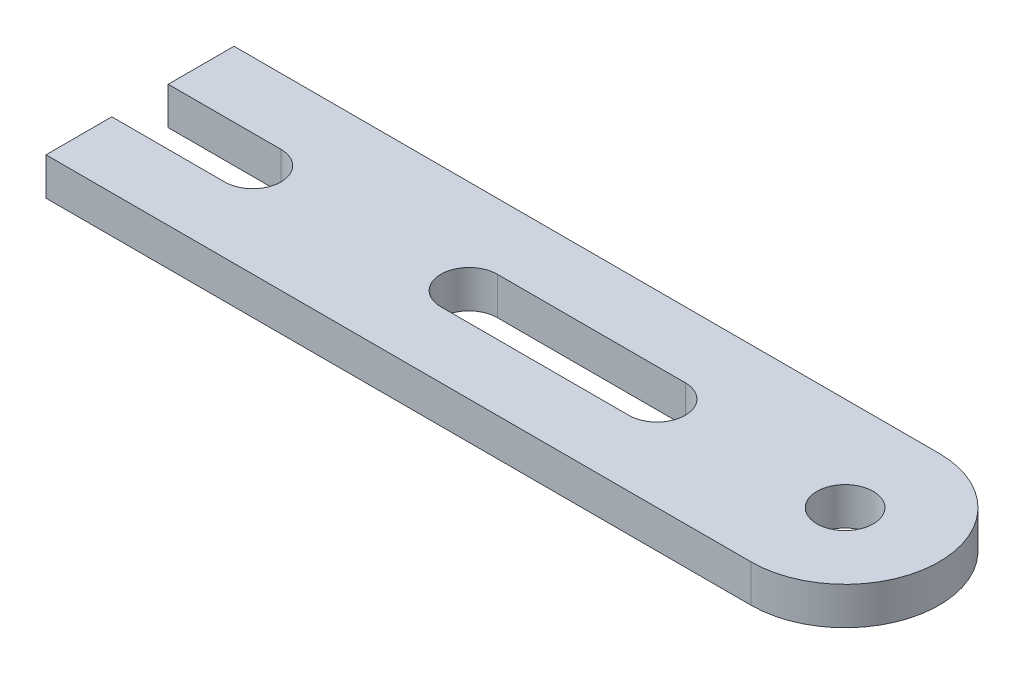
ISO-10303-21;
HEADER;
FILE_DESCRIPTION(('STEP AP214'),'2;1');
FILE_NAME('part.step','',(''),(''),'','','');
FILE_SCHEMA(('AUTOMOTIVE_DESIGN { 1 0 10303 214 1 1 1 1 }'));
ENDSEC;
DATA;
#1=APPLICATION_CONTEXT('core data for automotive mechanical design processes');
#2=APPLICATION_PROTOCOL_DEFINITION('international standard','automotive_design',2000,#1);
#3=PRODUCT_CONTEXT('',#1,'mechanical');
#4=PRODUCT('Part','Part','',(#3));
#5=PRODUCT_RELATED_PRODUCT_CATEGORY('part','',(#4));
#6=PRODUCT_DEFINITION_FORMATION('','',#4);
#7=PRODUCT_DEFINITION_CONTEXT('part definition',#1,'design');
#8=PRODUCT_DEFINITION('design','',#6,#7);
#9=PRODUCT_DEFINITION_SHAPE('','',#8);
#10=(LENGTH_UNIT() NAMED_UNIT(*) SI_UNIT(.MILLI.,.METRE.));
#11=(NAMED_UNIT(*) PLANE_ANGLE_UNIT() SI_UNIT($,.RADIAN.));
#12=(NAMED_UNIT(*) SI_UNIT($,.STERADIAN.) SOLID_ANGLE_UNIT());
#13=UNCERTAINTY_MEASURE_WITH_UNIT(LENGTH_MEASURE(1.E-05),#10,'distance_accuracy_value','');
#14=(GEOMETRIC_REPRESENTATION_CONTEXT(3) GLOBAL_UNCERTAINTY_ASSIGNED_CONTEXT((#13)) GLOBAL_UNIT_ASSIGNED_CONTEXT((#10,
#11,#12)) REPRESENTATION_CONTEXT('',''));
#15=CARTESIAN_POINT('',(0.,0.,0.));
#16=DIRECTION('',(0.,0.,1.));
#17=DIRECTION('',(1.,0.,0.));
#18=AXIS2_PLACEMENT_3D('',#15,#16,#17);
#19=CARTESIAN_POINT('',(0.,4.,0.));
#20=DIRECTION('',(0.,0.,-1.));
#21=DIRECTION('',(-1.,0.,0.));
#22=AXIS2_PLACEMENT_3D('',#19,#20,#21);
#23=PLANE('',#22);
#24=DIRECTION('',(0.,1.,0.));
#25=VECTOR('',#24,1.);
#26=CARTESIAN_POINT('',(75.,0.,0.));
#27=LINE('',#26,#25);
#28=CARTESIAN_POINT('',(75.,0.,0.));
#29=VERTEX_POINT('',#28);
#30=CARTESIAN_POINT('',(75.,4.,0.));
#31=VERTEX_POINT('',#30);
#32=EDGE_CURVE('E48',#29,#31,#27,.T.);
#33=ORIENTED_EDGE('',*,*,#32,.T.);
#34=DIRECTION('',(1.,0.,0.));
#35=VECTOR('',#34,1.);
#36=CARTESIAN_POINT('',(0.,4.,0.));
#37=LINE('',#36,#35);
#38=CARTESIAN_POINT('',(0.,4.,0.));
#39=VERTEX_POINT('',#38);
#40=EDGE_CURVE('E154',#39,#31,#37,.T.);
#41=ORIENTED_EDGE('',*,*,#40,.F.);
#42=DIRECTION('',(0.,-1.,0.));
#43=VECTOR('',#42,1.);
#44=CARTESIAN_POINT('',(0.,4.,0.));
#45=LINE('',#44,#43);
#46=CARTESIAN_POINT('',(0.,0.,0.));
#47=VERTEX_POINT('',#46);
#48=EDGE_CURVE('E11',#39,#47,#45,.T.);
#49=ORIENTED_EDGE('',*,*,#48,.T.);
#50=DIRECTION('',(1.,0.,0.));
#51=VECTOR('',#50,1.);
#52=CARTESIAN_POINT('',(0.,0.,0.));
#53=LINE('',#52,#51);
#54=EDGE_CURVE('E146',#47,#29,#53,.T.);
#55=ORIENTED_EDGE('',*,*,#54,.T.);
#56=EDGE_LOOP('',(#33,#41,#49,#55));
#57=FACE_BOUND('',#56,.T.);
#58=ADVANCED_FACE('F33',(#57),#23,.F.);
#59=CARTESIAN_POINT('',(0.,4.,0.));
#60=DIRECTION('',(1.,0.,0.));
#61=DIRECTION('',(0.,0.,-1.));
#62=AXIS2_PLACEMENT_3D('',#59,#60,#61);
#63=PLANE('',#62);
#64=DIRECTION('',(0.,0.,1.));
#65=VECTOR('',#64,1.);
#66=CARTESIAN_POINT('',(0.,4.,0.));
#67=LINE('',#66,#65);
#68=CARTESIAN_POINT('',(0.,4.,-7.));
#69=VERTEX_POINT('',#68);
#70=EDGE_CURVE('E145',#69,#39,#67,.T.);
#71=ORIENTED_EDGE('',*,*,#70,.F.);
#72=DIRECTION('',(0.,1.,0.));
#73=VECTOR('',#72,1.);
#74=CARTESIAN_POINT('',(0.,0.,-7.));
#75=LINE('',#74,#73);
#76=CARTESIAN_POINT('',(0.,0.,-7.));
#77=VERTEX_POINT('',#76);
#78=EDGE_CURVE('E181',#77,#69,#75,.T.);
#79=ORIENTED_EDGE('',*,*,#78,.F.);
#80=DIRECTION('',(0.,0.,1.));
#81=VECTOR('',#80,1.);
#82=CARTESIAN_POINT('',(0.,0.,0.));
#83=LINE('',#82,#81);
#84=EDGE_CURVE('E160',#77,#47,#83,.T.);
#85=ORIENTED_EDGE('',*,*,#84,.T.);
#86=ORIENTED_EDGE('',*,*,#48,.F.);
#87=EDGE_LOOP('',(#71,#79,#85,#86));
#88=FACE_BOUND('',#87,.T.);
#89=ADVANCED_FACE('F247',(#88),#63,.F.);
#90=CARTESIAN_POINT('',(0.,0.,-20.));
#91=VERTEX_POINT('',#90);
#92=CARTESIAN_POINT('',(0.,0.,-13.));
#93=VERTEX_POINT('',#92);
#94=EDGE_CURVE('E144',#91,#93,#83,.T.);
#95=ORIENTED_EDGE('',*,*,#94,.T.);
#96=DIRECTION('',(0.,1.,0.));
#97=VECTOR('',#96,1.);
#98=CARTESIAN_POINT('',(0.,0.,-13.));
#99=LINE('',#98,#97);
#100=CARTESIAN_POINT('',(0.,4.,-13.));
#101=VERTEX_POINT('',#100);
#102=EDGE_CURVE('E56',#93,#101,#99,.T.);
#103=ORIENTED_EDGE('',*,*,#102,.T.);
#104=CARTESIAN_POINT('',(0.,4.,-20.));
#105=VERTEX_POINT('',#104);
#106=EDGE_CURVE('E148',#105,#101,#67,.T.);
#107=ORIENTED_EDGE('',*,*,#106,.F.);
#108=DIRECTION('',(0.,-1.,0.));
#109=VECTOR('',#108,1.);
#110=CARTESIAN_POINT('',(0.,4.,-20.));
#111=LINE('',#110,#109);
#112=EDGE_CURVE('E41',#105,#91,#111,.T.);
#113=ORIENTED_EDGE('',*,*,#112,.T.);
#114=EDGE_LOOP('',(#95,#103,#107,#113));
#115=FACE_BOUND('',#114,.T.);
#116=ADVANCED_FACE('F35',(#115),#63,.F.);
#117=CARTESIAN_POINT('',(0.,4.,-20.));
#118=DIRECTION('',(0.,0.,1.));
#119=DIRECTION('',(1.,0.,0.));
#120=AXIS2_PLACEMENT_3D('',#117,#118,#119);
#121=PLANE('',#120);
#122=DIRECTION('',(-1.,0.,0.));
#123=VECTOR('',#122,1.);
#124=CARTESIAN_POINT('',(0.,4.,-20.));
#125=LINE('',#124,#123);
#126=CARTESIAN_POINT('',(75.,4.,-20.));
#127=VERTEX_POINT('',#126);
#128=EDGE_CURVE('E137',#127,#105,#125,.T.);
#129=ORIENTED_EDGE('',*,*,#128,.F.);
#130=DIRECTION('',(0.,1.,0.));
#131=VECTOR('',#130,1.);
#132=CARTESIAN_POINT('',(75.,0.,-20.));
#133=LINE('',#132,#131);
#134=CARTESIAN_POINT('',(75.,0.,-20.));
#135=VERTEX_POINT('',#134);
#136=EDGE_CURVE('E123',#135,#127,#133,.T.);
#137=ORIENTED_EDGE('',*,*,#136,.F.);
#138=DIRECTION('',(-1.,0.,0.));
#139=VECTOR('',#138,1.);
#140=CARTESIAN_POINT('',(0.,0.,-20.));
#141=LINE('',#140,#139);
#142=EDGE_CURVE('E135',#135,#91,#141,.T.);
#143=ORIENTED_EDGE('',*,*,#142,.T.);
#144=ORIENTED_EDGE('',*,*,#112,.F.);
#145=EDGE_LOOP('',(#129,#137,#143,#144));
#146=FACE_BOUND('',#145,.T.);
#147=ADVANCED_FACE('F133',(#146),#121,.F.);
#148=CARTESIAN_POINT('',(0.,4.,-20.));
#149=DIRECTION('',(0.,-1.,0.));
#150=DIRECTION('',(0.,0.,-1.));
#151=AXIS2_PLACEMENT_3D('',#148,#149,#150);
#152=PLANE('',#151);
#153=DIRECTION('',(1.,0.,0.));
#154=VECTOR('',#153,1.);
#155=CARTESIAN_POINT('',(35.,4.,-7.));
#156=LINE('',#155,#154);
#157=CARTESIAN_POINT('',(35.,4.,-7.));
#158=VERTEX_POINT('',#157);
#159=CARTESIAN_POINT('',(55.,4.,-7.));
#160=VERTEX_POINT('',#159);
#161=EDGE_CURVE('E205',#158,#160,#156,.T.);
#162=ORIENTED_EDGE('',*,*,#161,.F.);
#163=CARTESIAN_POINT('',(35.,4.,-10.));
#164=DIRECTION('',(0.,1.,0.));
#165=DIRECTION('',(0.,0.,1.));
#166=AXIS2_PLACEMENT_3D('',#163,#164,#165);
#167=CIRCLE('',#166,3.);
#168=CARTESIAN_POINT('',(35.,4.,-13.));
#169=VERTEX_POINT('',#168);
#170=EDGE_CURVE('E203',#169,#158,#167,.T.);
#171=ORIENTED_EDGE('',*,*,#170,.F.);
#172=DIRECTION('',(-1.,0.,0.));
#173=VECTOR('',#172,1.);
#174=CARTESIAN_POINT('',(35.,4.,-13.));
#175=LINE('',#174,#173);
#176=CARTESIAN_POINT('',(55.,4.,-13.));
#177=VERTEX_POINT('',#176);
#178=EDGE_CURVE('E194',#177,#169,#175,.T.);
#179=ORIENTED_EDGE('',*,*,#178,.F.);
#180=CARTESIAN_POINT('',(55.,4.,-10.));
#181=DIRECTION('',(0.,1.,0.));
#182=DIRECTION('',(0.,0.,1.));
#183=AXIS2_PLACEMENT_3D('',#180,#181,#182);
#184=CIRCLE('',#183,3.);
#185=EDGE_CURVE('E208',#160,#177,#184,.T.);
#186=ORIENTED_EDGE('',*,*,#185,.F.);
#187=EDGE_LOOP('',(#162,#171,#179,#186));
#188=FACE_BOUND('',#187,.T.);
#189=CARTESIAN_POINT('',(75.,4.,-10.));
#190=DIRECTION('',(0.,1.,0.));
#191=DIRECTION('',(0.,0.,1.));
#192=AXIS2_PLACEMENT_3D('',#189,#190,#191);
#193=CIRCLE('',#192,3.00000000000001);
#194=CARTESIAN_POINT('',(75.,4.,-6.99999999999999));
#195=VERTEX_POINT('',#194);
#196=EDGE_CURVE('E167',#195,#195,#193,.T.);
#197=ORIENTED_EDGE('',*,*,#196,.F.);
#198=EDGE_LOOP('',(#197));
#199=FACE_BOUND('',#198,.T.);
#200=ORIENTED_EDGE('',*,*,#40,.T.);
#201=CARTESIAN_POINT('',(75.,4.,-10.));
#202=DIRECTION('',(0.,-1.,0.));
#203=DIRECTION('',(0.,0.,1.));
#204=AXIS2_PLACEMENT_3D('',#201,#202,#203);
#205=CIRCLE('',#204,10.);
#206=EDGE_CURVE('E129',#127,#31,#205,.T.);
#207=ORIENTED_EDGE('',*,*,#206,.F.);
#208=ORIENTED_EDGE('',*,*,#128,.T.);
#209=ORIENTED_EDGE('',*,*,#106,.T.);
#210=DIRECTION('',(-1.,0.,0.));
#211=VECTOR('',#210,1.);
#212=CARTESIAN_POINT('',(12.,4.,-13.));
#213=LINE('',#212,#211);
#214=CARTESIAN_POINT('',(12.,4.,-13.));
#215=VERTEX_POINT('',#214);
#216=EDGE_CURVE('E180',#215,#101,#213,.T.);
#217=ORIENTED_EDGE('',*,*,#216,.F.);
#218=CARTESIAN_POINT('',(12.,4.,-10.));
#219=DIRECTION('',(0.,1.,0.));
#220=DIRECTION('',(0.,0.,1.));
#221=AXIS2_PLACEMENT_3D('',#218,#219,#220);
#222=CIRCLE('',#221,3.);
#223=CARTESIAN_POINT('',(12.,4.,-7.));
#224=VERTEX_POINT('',#223);
#225=EDGE_CURVE('E138',#224,#215,#222,.T.);
#226=ORIENTED_EDGE('',*,*,#225,.F.);
#227=DIRECTION('',(1.,0.,0.));
#228=VECTOR('',#227,1.);
#229=CARTESIAN_POINT('',(12.,4.,-7.));
#230=LINE('',#229,#228);
#231=EDGE_CURVE('E340',#69,#224,#230,.T.);
#232=ORIENTED_EDGE('',*,*,#231,.F.);
#233=ORIENTED_EDGE('',*,*,#70,.T.);
#234=EDGE_LOOP('',(#200,#207,#208,#209,#217,#226,#232,#233));
#235=FACE_BOUND('',#234,.T.);
#236=ADVANCED_FACE('F178',(#188,#199,#235),#152,.F.);
#237=CARTESIAN_POINT('',(0.,0.,-20.));
#238=DIRECTION('',(0.,-1.,0.));
#239=DIRECTION('',(0.,0.,-1.));
#240=AXIS2_PLACEMENT_3D('',#237,#238,#239);
#241=PLANE('',#240);
#242=CARTESIAN_POINT('',(75.,0.,-10.));
#243=DIRECTION('',(0.,-1.,0.));
#244=DIRECTION('',(0.,0.,1.));
#245=AXIS2_PLACEMENT_3D('',#242,#243,#244);
#246=CIRCLE('',#245,10.);
#247=EDGE_CURVE('E120',#135,#29,#246,.T.);
#248=ORIENTED_EDGE('',*,*,#247,.T.);
#249=ORIENTED_EDGE('',*,*,#54,.F.);
#250=ORIENTED_EDGE('',*,*,#84,.F.);
#251=DIRECTION('',(1.,0.,0.));
#252=VECTOR('',#251,1.);
#253=CARTESIAN_POINT('',(12.,0.,-7.));
#254=LINE('',#253,#252);
#255=CARTESIAN_POINT('',(12.,0.,-7.));
#256=VERTEX_POINT('',#255);
#257=EDGE_CURVE('E186',#77,#256,#254,.T.);
#258=ORIENTED_EDGE('',*,*,#257,.T.);
#259=CARTESIAN_POINT('',(12.,0.,-10.));
#260=DIRECTION('',(0.,1.,0.));
#261=DIRECTION('',(0.,0.,1.));
#262=AXIS2_PLACEMENT_3D('',#259,#260,#261);
#263=CIRCLE('',#262,3.);
#264=CARTESIAN_POINT('',(12.,0.,-13.));
#265=VERTEX_POINT('',#264);
#266=EDGE_CURVE('E343',#256,#265,#263,.T.);
#267=ORIENTED_EDGE('',*,*,#266,.T.);
#268=DIRECTION('',(-1.,0.,0.));
#269=VECTOR('',#268,1.);
#270=CARTESIAN_POINT('',(12.,0.,-13.));
#271=LINE('',#270,#269);
#272=EDGE_CURVE('E357',#265,#93,#271,.T.);
#273=ORIENTED_EDGE('',*,*,#272,.T.);
#274=ORIENTED_EDGE('',*,*,#94,.F.);
#275=ORIENTED_EDGE('',*,*,#142,.F.);
#276=EDGE_LOOP('',(#248,#249,#250,#258,#267,#273,#274,#275));
#277=FACE_BOUND('',#276,.T.);
#278=CARTESIAN_POINT('',(35.,0.,-10.));
#279=DIRECTION('',(0.,1.,0.));
#280=DIRECTION('',(0.,0.,1.));
#281=AXIS2_PLACEMENT_3D('',#278,#279,#280);
#282=CIRCLE('',#281,3.);
#283=CARTESIAN_POINT('',(35.,0.,-13.));
#284=VERTEX_POINT('',#283);
#285=CARTESIAN_POINT('',(35.,0.,-7.));
#286=VERTEX_POINT('',#285);
#287=EDGE_CURVE('E190',#284,#286,#282,.T.);
#288=ORIENTED_EDGE('',*,*,#287,.T.);
#289=DIRECTION('',(1.,0.,0.));
#290=VECTOR('',#289,1.);
#291=CARTESIAN_POINT('',(35.,0.,-7.));
#292=LINE('',#291,#290);
#293=CARTESIAN_POINT('',(55.,0.,-7.));
#294=VERTEX_POINT('',#293);
#295=EDGE_CURVE('E193',#286,#294,#292,.T.);
#296=ORIENTED_EDGE('',*,*,#295,.T.);
#297=CARTESIAN_POINT('',(55.,0.,-10.));
#298=DIRECTION('',(0.,1.,0.));
#299=DIRECTION('',(0.,0.,1.));
#300=AXIS2_PLACEMENT_3D('',#297,#298,#299);
#301=CIRCLE('',#300,3.);
#302=CARTESIAN_POINT('',(55.,0.,-13.));
#303=VERTEX_POINT('',#302);
#304=EDGE_CURVE('E197',#294,#303,#301,.T.);
#305=ORIENTED_EDGE('',*,*,#304,.T.);
#306=DIRECTION('',(-1.,0.,0.));
#307=VECTOR('',#306,1.);
#308=CARTESIAN_POINT('',(35.,0.,-13.));
#309=LINE('',#308,#307);
#310=EDGE_CURVE('E200',#303,#284,#309,.T.);
#311=ORIENTED_EDGE('',*,*,#310,.T.);
#312=EDGE_LOOP('',(#288,#296,#305,#311));
#313=FACE_BOUND('',#312,.T.);
#314=CARTESIAN_POINT('',(75.,0.,-10.));
#315=DIRECTION('',(0.,1.,0.));
#316=DIRECTION('',(0.,0.,1.));
#317=AXIS2_PLACEMENT_3D('',#314,#315,#316);
#318=CIRCLE('',#317,3.00000000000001);
#319=CARTESIAN_POINT('',(75.,0.,-6.99999999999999));
#320=VERTEX_POINT('',#319);
#321=EDGE_CURVE('E161',#320,#320,#318,.T.);
#322=ORIENTED_EDGE('',*,*,#321,.T.);
#323=EDGE_LOOP('',(#322));
#324=FACE_BOUND('',#323,.T.);
#325=ADVANCED_FACE('F141',(#277,#313,#324),#241,.T.);
#326=CARTESIAN_POINT('',(75.,0.,-10.));
#327=DIRECTION('',(0.,1.,0.));
#328=DIRECTION('',(0.,0.,1.));
#329=AXIS2_PLACEMENT_3D('',#326,#327,#328);
#330=CYLINDRICAL_SURFACE('',#329,3.00000000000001);
#331=ORIENTED_EDGE('',*,*,#321,.F.);
#332=EDGE_LOOP('',(#331));
#333=FACE_BOUND('',#332,.T.);
#334=ORIENTED_EDGE('',*,*,#196,.T.);
#335=EDGE_LOOP('',(#334));
#336=FACE_BOUND('',#335,.T.);
#337=ADVANCED_FACE('F236',(#333,#336),#330,.F.);
#338=CARTESIAN_POINT('',(35.,0.,-10.));
#339=DIRECTION('',(0.,1.,0.));
#340=DIRECTION('',(0.,0.,1.));
#341=AXIS2_PLACEMENT_3D('',#338,#339,#340);
#342=CYLINDRICAL_SURFACE('',#341,3.);
#343=ORIENTED_EDGE('',*,*,#170,.T.);
#344=DIRECTION('',(0.,1.,0.));
#345=VECTOR('',#344,1.);
#346=CARTESIAN_POINT('',(35.,0.,-7.));
#347=LINE('',#346,#345);
#348=EDGE_CURVE('E175',#286,#158,#347,.T.);
#349=ORIENTED_EDGE('',*,*,#348,.F.);
#350=ORIENTED_EDGE('',*,*,#287,.F.);
#351=DIRECTION('',(0.,1.,0.));
#352=VECTOR('',#351,1.);
#353=CARTESIAN_POINT('',(35.,0.,-13.));
#354=LINE('',#353,#352);
#355=EDGE_CURVE('E172',#284,#169,#354,.T.);
#356=ORIENTED_EDGE('',*,*,#355,.T.);
#357=EDGE_LOOP('',(#343,#349,#350,#356));
#358=FACE_BOUND('',#357,.T.);
#359=ADVANCED_FACE('F234',(#358),#342,.F.);
#360=CARTESIAN_POINT('',(35.,0.,-13.));
#361=DIRECTION('',(0.,0.,-1.));
#362=DIRECTION('',(-1.,0.,0.));
#363=AXIS2_PLACEMENT_3D('',#360,#361,#362);
#364=PLANE('',#363);
#365=ORIENTED_EDGE('',*,*,#178,.T.);
#366=ORIENTED_EDGE('',*,*,#355,.F.);
#367=ORIENTED_EDGE('',*,*,#310,.F.);
#368=DIRECTION('',(0.,1.,0.));
#369=VECTOR('',#368,1.);
#370=CARTESIAN_POINT('',(55.,0.,-13.));
#371=LINE('',#370,#369);
#372=EDGE_CURVE('E214',#303,#177,#371,.T.);
#373=ORIENTED_EDGE('',*,*,#372,.T.);
#374=EDGE_LOOP('',(#365,#366,#367,#373));
#375=FACE_BOUND('',#374,.T.);
#376=ADVANCED_FACE('F233',(#375),#364,.F.);
#377=CARTESIAN_POINT('',(55.,0.,-10.));
#378=DIRECTION('',(0.,1.,0.));
#379=DIRECTION('',(0.,0.,1.));
#380=AXIS2_PLACEMENT_3D('',#377,#378,#379);
#381=CYLINDRICAL_SURFACE('',#380,3.);
#382=ORIENTED_EDGE('',*,*,#185,.T.);
#383=ORIENTED_EDGE('',*,*,#372,.F.);
#384=ORIENTED_EDGE('',*,*,#304,.F.);
#385=DIRECTION('',(0.,1.,0.));
#386=VECTOR('',#385,1.);
#387=CARTESIAN_POINT('',(55.,0.,-7.));
#388=LINE('',#387,#386);
#389=EDGE_CURVE('E215',#294,#160,#388,.T.);
#390=ORIENTED_EDGE('',*,*,#389,.T.);
#391=EDGE_LOOP('',(#382,#383,#384,#390));
#392=FACE_BOUND('',#391,.T.);
#393=ADVANCED_FACE('F230',(#392),#381,.F.);
#394=CARTESIAN_POINT('',(35.,0.,-7.));
#395=DIRECTION('',(0.,0.,1.));
#396=DIRECTION('',(1.,0.,0.));
#397=AXIS2_PLACEMENT_3D('',#394,#395,#396);
#398=PLANE('',#397);
#399=ORIENTED_EDGE('',*,*,#161,.T.);
#400=ORIENTED_EDGE('',*,*,#389,.F.);
#401=ORIENTED_EDGE('',*,*,#295,.F.);
#402=ORIENTED_EDGE('',*,*,#348,.T.);
#403=EDGE_LOOP('',(#399,#400,#401,#402));
#404=FACE_BOUND('',#403,.T.);
#405=ADVANCED_FACE('F222',(#404),#398,.F.);
#406=CARTESIAN_POINT('',(12.,0.,-10.));
#407=DIRECTION('',(0.,1.,0.));
#408=DIRECTION('',(0.,0.,1.));
#409=AXIS2_PLACEMENT_3D('',#406,#407,#408);
#410=CYLINDRICAL_SURFACE('',#409,3.);
#411=ORIENTED_EDGE('',*,*,#225,.T.);
#412=DIRECTION('',(0.,1.,0.));
#413=VECTOR('',#412,1.);
#414=CARTESIAN_POINT('',(12.,0.,-13.));
#415=LINE('',#414,#413);
#416=EDGE_CURVE('E182',#265,#215,#415,.T.);
#417=ORIENTED_EDGE('',*,*,#416,.F.);
#418=ORIENTED_EDGE('',*,*,#266,.F.);
#419=DIRECTION('',(0.,1.,0.));
#420=VECTOR('',#419,1.);
#421=CARTESIAN_POINT('',(12.,0.,-7.));
#422=LINE('',#421,#420);
#423=EDGE_CURVE('E184',#256,#224,#422,.T.);
#424=ORIENTED_EDGE('',*,*,#423,.T.);
#425=EDGE_LOOP('',(#411,#417,#418,#424));
#426=FACE_BOUND('',#425,.T.);
#427=ADVANCED_FACE('F300',(#426),#410,.F.);
#428=CARTESIAN_POINT('',(12.,0.,-7.));
#429=DIRECTION('',(0.,0.,1.));
#430=DIRECTION('',(1.,0.,0.));
#431=AXIS2_PLACEMENT_3D('',#428,#429,#430);
#432=PLANE('',#431);
#433=ORIENTED_EDGE('',*,*,#231,.T.);
#434=ORIENTED_EDGE('',*,*,#423,.F.);
#435=ORIENTED_EDGE('',*,*,#257,.F.);
#436=ORIENTED_EDGE('',*,*,#78,.T.);
#437=EDGE_LOOP('',(#433,#434,#435,#436));
#438=FACE_BOUND('',#437,.T.);
#439=ADVANCED_FACE('F308',(#438),#432,.F.);
#440=CARTESIAN_POINT('',(12.,0.,-13.));
#441=DIRECTION('',(0.,0.,-1.));
#442=DIRECTION('',(-1.,0.,0.));
#443=AXIS2_PLACEMENT_3D('',#440,#441,#442);
#444=PLANE('',#443);
#445=ORIENTED_EDGE('',*,*,#216,.T.);
#446=ORIENTED_EDGE('',*,*,#102,.F.);
#447=ORIENTED_EDGE('',*,*,#272,.F.);
#448=ORIENTED_EDGE('',*,*,#416,.T.);
#449=EDGE_LOOP('',(#445,#446,#447,#448));
#450=FACE_BOUND('',#449,.T.);
#451=ADVANCED_FACE('F318',(#450),#444,.F.);
#452=CARTESIAN_POINT('',(75.,0.,-10.));
#453=DIRECTION('',(0.,1.,0.));
#454=DIRECTION('',(0.,0.,1.));
#455=AXIS2_PLACEMENT_3D('',#452,#453,#454);
#456=CYLINDRICAL_SURFACE('',#455,10.);
#457=ORIENTED_EDGE('',*,*,#206,.T.);
#458=ORIENTED_EDGE('',*,*,#32,.F.);
#459=ORIENTED_EDGE('',*,*,#247,.F.);
#460=ORIENTED_EDGE('',*,*,#136,.T.);
#461=EDGE_LOOP('',(#457,#458,#459,#460));
#462=FACE_BOUND('',#461,.T.);
#463=ADVANCED_FACE('F122',(#462),#456,.T.);
#464=CLOSED_SHELL('',(#58,#89,#116,#147,#236,#325,#337,#359,#376,#393,#405,#427,#439,#451,#463));
#465=MANIFOLD_SOLID_BREP('B2',#464);
#466=ADVANCED_BREP_SHAPE_REPRESENTATION('',(#18,#465),#14);
#467=SHAPE_DEFINITION_REPRESENTATION(#9,#466);
ENDSEC;
END-ISO-10303-21;
